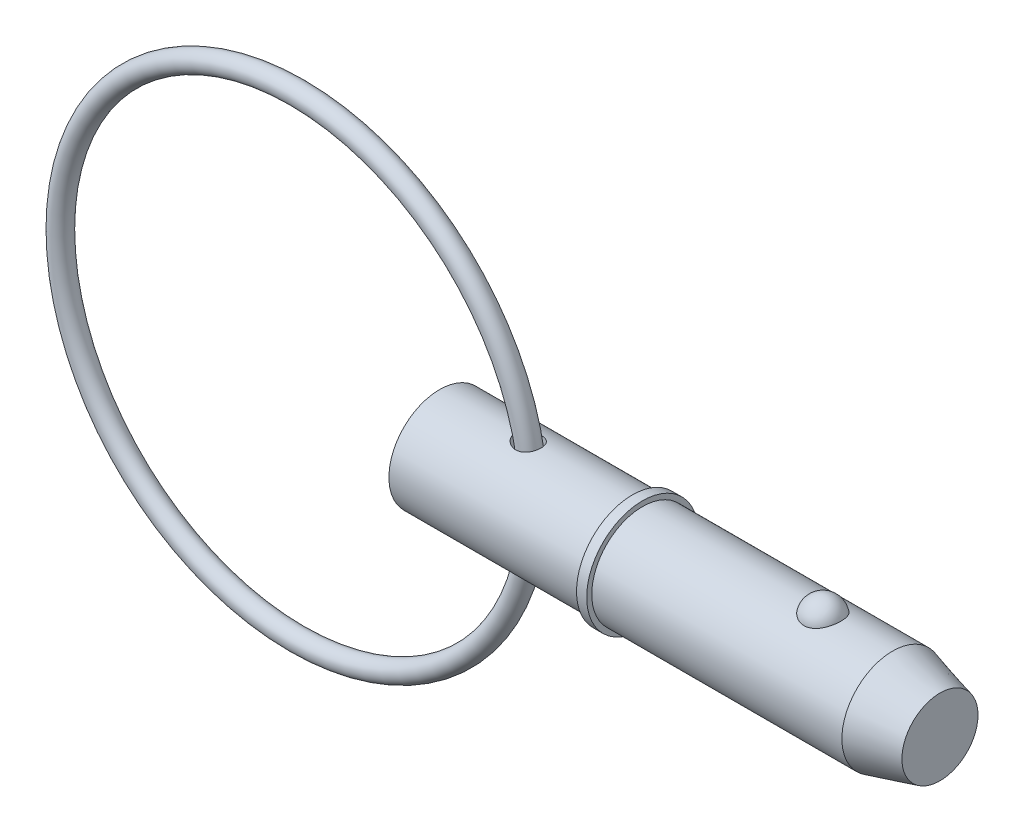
ISO-10303-21;
HEADER;
FILE_DESCRIPTION(('STEP AP214'),'2;1');
FILE_NAME('part.step','',(''),(''),'','','');
FILE_SCHEMA(('AUTOMOTIVE_DESIGN { 1 0 10303 214 1 1 1 1 }'));
ENDSEC;
DATA;
#1=APPLICATION_CONTEXT('core data for automotive mechanical design processes');
#2=APPLICATION_PROTOCOL_DEFINITION('international standard','automotive_design',2000,#1);
#3=PRODUCT_CONTEXT('',#1,'mechanical');
#4=PRODUCT('Part','Part','',(#3));
#5=PRODUCT_RELATED_PRODUCT_CATEGORY('part','',(#4));
#6=PRODUCT_DEFINITION_FORMATION('','',#4);
#7=PRODUCT_DEFINITION_CONTEXT('part definition',#1,'design');
#8=PRODUCT_DEFINITION('design','',#6,#7);
#9=PRODUCT_DEFINITION_SHAPE('','',#8);
#10=(LENGTH_UNIT() NAMED_UNIT(*) SI_UNIT(.MILLI.,.METRE.));
#11=(NAMED_UNIT(*) PLANE_ANGLE_UNIT() SI_UNIT($,.RADIAN.));
#12=(NAMED_UNIT(*) SI_UNIT($,.STERADIAN.) SOLID_ANGLE_UNIT());
#13=UNCERTAINTY_MEASURE_WITH_UNIT(LENGTH_MEASURE(1.E-05),#10,'distance_accuracy_value','');
#14=(GEOMETRIC_REPRESENTATION_CONTEXT(3) GLOBAL_UNCERTAINTY_ASSIGNED_CONTEXT((#13)) GLOBAL_UNIT_ASSIGNED_CONTEXT((#10,
#11,#12)) REPRESENTATION_CONTEXT('',''));
#15=CARTESIAN_POINT('',(0.,0.,0.));
#16=DIRECTION('',(0.,0.,1.));
#17=DIRECTION('',(1.,0.,0.));
#18=AXIS2_PLACEMENT_3D('',#15,#16,#17);
#19=CARTESIAN_POINT('',(-13.4013067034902,0.,0.));
#20=DIRECTION('',(0.,0.,1.));
#21=DIRECTION('',(1.,0.,0.));
#22=AXIS2_PLACEMENT_3D('',#19,#20,#21);
#23=TOROIDAL_SURFACE('',#22,22.225,0.952999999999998);
#24=CARTESIAN_POINT('',(9.77669329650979,0.,0.));
#25=VERTEX_POINT('',#24);
#26=VERTEX_LOOP('',#25);
#27=FACE_BOUND('',#26,.T.);
#28=ADVANCED_FACE('P0_F12',(#27),#23,.T.);
#29=CLOSED_SHELL('',(#28));
#30=MANIFOLD_SOLID_BREP('P0_B1',#29);
#31=CARTESIAN_POINT('',(0.,0.,0.));
#32=DIRECTION('',(1.,0.,0.));
#33=DIRECTION('',(0.,0.,-1.));
#34=AXIS2_PLACEMENT_3D('',#31,#32,#33);
#35=CYLINDRICAL_SURFACE('',#34,4.765);
#36=CARTESIAN_POINT('',(7.31773584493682,4.71580709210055,-0.682926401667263));
#37=CARTESIAN_POINT('',(7.3607471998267,4.70750812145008,-0.740230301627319));
#38=CARTESIAN_POINT('',(7.40883112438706,4.69869300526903,-0.79371122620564));
#39=CARTESIAN_POINT('',(7.51340999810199,4.68106981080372,-0.89180043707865));
#40=CARTESIAN_POINT('',(7.56991882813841,4.67226176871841,-0.936393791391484));
#41=CARTESIAN_POINT('',(7.689548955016,4.65568581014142,-1.01560363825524));
#42=CARTESIAN_POINT('',(7.75265928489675,4.64791621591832,-1.05023633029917));
#43=CARTESIAN_POINT('',(7.88387110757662,4.6343185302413,-1.10870278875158));
#44=CARTESIAN_POINT('',(7.95197058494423,4.62848966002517,-1.13254088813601));
#45=CARTESIAN_POINT('',(8.09209413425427,4.6194749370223,-1.16877415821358));
#46=CARTESIAN_POINT('',(8.16415141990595,4.6163169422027,-1.18104886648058));
#47=CARTESIAN_POINT('',(8.30937958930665,4.61324608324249,-1.19299123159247));
#48=CARTESIAN_POINT('',(8.38255011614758,4.61333220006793,-1.19266284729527));
#49=CARTESIAN_POINT('',(8.52374186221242,4.61674026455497,-1.17939593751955));
#50=CARTESIAN_POINT('',(8.59183022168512,4.61989017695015,-1.16712781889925));
#51=CARTESIAN_POINT('',(8.72470143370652,4.62884731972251,-1.13107903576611));
#52=CARTESIAN_POINT('',(8.78948513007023,4.63465386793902,-1.10730132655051));
#53=CARTESIAN_POINT('',(8.91088768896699,4.64792402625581,-1.05016249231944));
#54=CARTESIAN_POINT('',(8.96774302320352,4.65530108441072,-1.01728198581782));
#55=CARTESIAN_POINT('',(9.07499804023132,4.67102002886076,-0.942471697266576));
#56=CARTESIAN_POINT('',(9.12539777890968,4.6793619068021,-0.900541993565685));
#57=CARTESIAN_POINT('',(9.21836221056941,4.69607497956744,-0.808868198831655));
#58=CARTESIAN_POINT('',(9.26093651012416,4.70444612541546,-0.759133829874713));
#59=CARTESIAN_POINT('',(9.33728390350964,4.72032100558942,-0.653192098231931));
#60=CARTESIAN_POINT('',(9.3710564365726,4.72782468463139,-0.596984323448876));
#61=CARTESIAN_POINT('',(9.42940600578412,4.74126034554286,-0.478808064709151));
#62=CARTESIAN_POINT('',(9.45384681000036,4.74716869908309,-0.416769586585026));
#63=CARTESIAN_POINT('',(9.49226260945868,4.75663465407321,-0.289362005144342));
#64=CARTESIAN_POINT('',(9.50623742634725,4.76019221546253,-0.22399284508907));
#65=CARTESIAN_POINT('',(9.52342004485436,4.76458450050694,-0.0914886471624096));
#66=CARTESIAN_POINT('',(9.52658321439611,4.7654079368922,-0.0243474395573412));
#67=CARTESIAN_POINT('',(9.52194012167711,4.76421136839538,0.109528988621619));
#68=CARTESIAN_POINT('',(9.51413380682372,4.7621913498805,0.176264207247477));
#69=CARTESIAN_POINT('',(9.48775485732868,4.75552896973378,0.307367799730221));
#70=CARTESIAN_POINT('',(9.4691926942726,4.75088915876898,0.371738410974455));
#71=CARTESIAN_POINT('',(9.42175836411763,4.73949008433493,0.496364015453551));
#72=CARTESIAN_POINT('',(9.39288586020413,4.73273075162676,0.556618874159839));
#73=CARTESIAN_POINT('',(9.32549385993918,4.71782154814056,0.671371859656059));
#74=CARTESIAN_POINT('',(9.28696367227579,4.70967013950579,0.725863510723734));
#75=CARTESIAN_POINT('',(9.20123305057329,4.6928883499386,0.827453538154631));
#76=CARTESIAN_POINT('',(9.15403300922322,4.68425799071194,0.874552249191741));
#77=CARTESIAN_POINT('',(9.05250467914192,4.66754854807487,0.959736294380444));
#78=CARTESIAN_POINT('',(8.99822095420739,4.65946646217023,0.997874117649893));
#79=CARTESIAN_POINT('',(8.88381123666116,4.64472049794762,1.06440739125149));
#80=CARTESIAN_POINT('',(8.82368614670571,4.63805640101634,1.09280434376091));
#81=CARTESIAN_POINT('',(8.70022952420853,4.62698068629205,1.13878427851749));
#82=CARTESIAN_POINT('',(8.63695594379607,4.62253830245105,1.15651569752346));
#83=CARTESIAN_POINT('',(8.50825296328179,4.61622454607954,1.18146656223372));
#84=CARTESIAN_POINT('',(8.44282353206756,4.61435321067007,1.18868585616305));
#85=CARTESIAN_POINT('',(8.31119087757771,4.61332122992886,1.19268442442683));
#86=CARTESIAN_POINT('',(8.24498542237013,4.61417920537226,1.18939198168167));
#87=CARTESIAN_POINT('',(8.11397487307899,4.61847671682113,1.17259121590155));
#88=CARTESIAN_POINT('',(8.04917011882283,4.62191687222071,1.15908044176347));
#89=CARTESIAN_POINT('',(7.91946226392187,4.63117528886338,1.12153047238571));
#90=CARTESIAN_POINT('',(7.85470460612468,4.6371000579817,1.09701575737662));
#91=CARTESIAN_POINT('',(7.7300035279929,4.65063246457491,1.03814807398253));
#92=CARTESIAN_POINT('',(7.67006197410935,4.65824075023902,1.00379131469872));
#93=CARTESIAN_POINT('',(7.55352765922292,4.67473656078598,0.924015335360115));
#94=CARTESIAN_POINT('',(7.49726947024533,4.68366994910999,0.878115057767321));
#95=CARTESIAN_POINT('',(7.39344083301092,4.70144936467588,0.777311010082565));
#96=CARTESIAN_POINT('',(7.34587087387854,4.71029538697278,0.722406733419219));
#97=CARTESIAN_POINT('',(7.26188955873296,4.72669773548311,0.605773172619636));
#98=CARTESIAN_POINT('',(7.22531316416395,4.73427229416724,0.544165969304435));
#99=CARTESIAN_POINT('',(7.16406269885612,4.74732663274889,0.415095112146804));
#100=CARTESIAN_POINT('',(7.13937848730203,4.75280819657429,0.347636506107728));
#101=CARTESIAN_POINT('',(7.10494917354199,4.7605495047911,0.215359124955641));
#102=CARTESIAN_POINT('',(7.09405441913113,4.76305589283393,0.150853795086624));
#103=CARTESIAN_POINT('',(7.08387189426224,4.76539656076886,0.0208839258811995));
#104=CARTESIAN_POINT('',(7.0845805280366,4.76523166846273,-0.0445803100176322));
#105=CARTESIAN_POINT('',(7.09709111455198,4.76236014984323,-0.169693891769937));
#106=CARTESIAN_POINT('',(7.10810913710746,4.75983315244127,-0.229428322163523));
#107=CARTESIAN_POINT('',(7.13959099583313,4.75276726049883,-0.346187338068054));
#108=CARTESIAN_POINT('',(7.16004881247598,4.7482296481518,-0.403213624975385));
#109=CARTESIAN_POINT('',(7.20270325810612,4.73907067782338,-0.498040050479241));
#110=CARTESIAN_POINT('',(7.22286864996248,4.73481668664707,-0.536809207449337));
#111=CARTESIAN_POINT('',(7.26730952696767,4.72570777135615,-0.611832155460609));
#112=CARTESIAN_POINT('',(7.29158512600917,4.72085283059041,-0.64808587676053));
#113=CARTESIAN_POINT('',(7.31773584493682,4.71580709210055,-0.682926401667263));
#114=B_SPLINE_CURVE_WITH_KNOTS('',3,(#36,#37,#38,#39,#40,#41,#42,#43,#44,#45,#46,#47,#48,#49,
#50,#51,#52,#53,#54,#55,#56,#57,#58,#59,#60,#61,#62,#63,#64,#65,#66,#67,#68,#69,#70,#71,#72,#73,
#74,#75,#76,#77,#78,#79,#80,#81,#82,#83,#84,#85,#86,#87,#88,#89,#90,#91,#92,#93,#94,#95,#96,#97,
#98,#99,#100,#101,#102,#103,#104,#105,#106,#107,#108,#109,#110,#111,#112,#113),.UNSPECIFIED.,
.T.,.F.,(4,2,2,2,2,2,2,2,2,2,2,2,2,2,2,2,2,2,2,2,2,2,2,2,2,2,2,2,2,2,2,2,2,2,2,2,2,2,4),(0.,
0.216219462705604,0.432799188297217,0.649024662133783,0.865163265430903,1.08352938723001,
1.30182691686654,1.50853487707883,1.71518978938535,1.91252381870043,2.1098561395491,
2.30694457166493,2.50404555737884,2.70392296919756,2.90380378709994,3.10450875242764,
3.30521468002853,3.5057255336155,3.70624293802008,3.90698330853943,4.10771458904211,
4.30723900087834,4.50673262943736,4.70338139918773,4.90003300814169,5.09802914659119,
5.29607279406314,5.5036500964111,5.7113074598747,5.92972727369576,6.14815938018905,
6.36312650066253,6.57790998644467,6.77325899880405,6.96854747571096,7.15009726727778,
7.33153144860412,7.46298830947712,7.59444881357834),.UNSPECIFIED.);
#115=CARTESIAN_POINT('',(7.31773584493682,4.71580709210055,-0.682926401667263));
#116=VERTEX_POINT('',#115);
#117=EDGE_CURVE('P1_E42',#116,#116,#114,.T.);
#118=ORIENTED_EDGE('',*,*,#117,.T.);
#119=EDGE_LOOP('',(#118));
#120=FACE_BOUND('',#119,.T.);
#121=CARTESIAN_POINT('',(0.,0.,0.));
#122=DIRECTION('',(1.,0.,0.));
#123=DIRECTION('',(0.,0.,-1.));
#124=AXIS2_PLACEMENT_3D('',#121,#122,#123);
#125=CIRCLE('',#124,4.765);
#126=CARTESIAN_POINT('',(0.,0.,-4.765));
#127=VERTEX_POINT('',#126);
#128=EDGE_CURVE('P1_E9',#127,#127,#125,.T.);
#129=ORIENTED_EDGE('',*,*,#128,.T.);
#130=EDGE_LOOP('',(#129));
#131=FACE_BOUND('',#130,.T.);
#132=CARTESIAN_POINT('',(18.097,0.,0.));
#133=DIRECTION('',(1.,0.,0.));
#134=DIRECTION('',(0.,0.,-1.));
#135=AXIS2_PLACEMENT_3D('',#132,#133,#134);
#136=CIRCLE('',#135,4.765);
#137=CARTESIAN_POINT('',(18.097,0.,-4.765));
#138=VERTEX_POINT('',#137);
#139=EDGE_CURVE('P1_E25',#138,#138,#136,.T.);
#140=ORIENTED_EDGE('',*,*,#139,.F.);
#141=EDGE_LOOP('',(#140));
#142=FACE_BOUND('',#141,.T.);
#143=CARTESIAN_POINT('',(7.31773584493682,-4.71580709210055,-0.682926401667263));
#144=CARTESIAN_POINT('',(7.27956054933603,-4.72317282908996,-0.63206220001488));
#145=CARTESIAN_POINT('',(7.24535712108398,-4.7301361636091,-0.578155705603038));
#146=CARTESIAN_POINT('',(7.18611785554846,-4.74256090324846,-0.465352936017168));
#147=CARTESIAN_POINT('',(7.16107836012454,-4.74802290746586,-0.406458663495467));
#148=CARTESIAN_POINT('',(7.12119149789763,-4.75686558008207,-0.284913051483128));
#149=CARTESIAN_POINT('',(7.1063796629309,-4.76023898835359,-0.222249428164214));
#150=CARTESIAN_POINT('',(7.08786546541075,-4.76447177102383,-0.0952170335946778));
#151=CARTESIAN_POINT('',(7.08416018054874,-4.76533180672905,-0.0308487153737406));
#152=CARTESIAN_POINT('',(7.08795686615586,-4.76445764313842,0.0942755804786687));
#153=CARTESIAN_POINT('',(7.09490366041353,-4.762851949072,0.155050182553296));
#154=CARTESIAN_POINT('',(7.11863973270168,-4.75746086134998,0.2745356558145));
#155=CARTESIAN_POINT('',(7.13542953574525,-4.75367535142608,0.333246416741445));
#156=CARTESIAN_POINT('',(7.17817193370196,-4.74430545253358,0.447305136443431));
#157=CARTESIAN_POINT('',(7.20415836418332,-4.73871442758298,0.502639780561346));
#158=CARTESIAN_POINT('',(7.26428068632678,-4.72628508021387,0.608523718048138));
#159=CARTESIAN_POINT('',(7.29841897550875,-4.71944639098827,0.659071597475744));
#160=CARTESIAN_POINT('',(7.37680984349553,-4.70456239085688,0.758311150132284));
#161=CARTESIAN_POINT('',(7.42165519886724,-4.69646426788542,0.806526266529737));
#162=CARTESIAN_POINT('',(7.51828933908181,-4.68032890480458,0.895428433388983));
#163=CARTESIAN_POINT('',(7.57008134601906,-4.67229169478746,0.936111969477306));
#164=CARTESIAN_POINT('',(7.68397204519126,-4.65640659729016,1.01229731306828));
#165=CARTESIAN_POINT('',(7.74657226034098,-4.64863251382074,1.04706751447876));
#166=CARTESIAN_POINT('',(7.87680110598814,-4.6349740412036,1.10596507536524));
#167=CARTESIAN_POINT('',(7.94443054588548,-4.62908995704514,1.13009071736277));
#168=CARTESIAN_POINT('',(8.08402017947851,-4.61989019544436,1.16713943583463));
#169=CARTESIAN_POINT('',(8.15603143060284,-4.61661596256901,1.17988211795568));
#170=CARTESIAN_POINT('',(8.30124697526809,-4.61330446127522,1.1927680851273));
#171=CARTESIAN_POINT('',(8.37445077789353,-4.61326589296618,1.19291642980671));
#172=CARTESIAN_POINT('',(8.51584800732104,-4.61644036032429,1.18056687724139));
#173=CARTESIAN_POINT('',(8.58410302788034,-4.61948317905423,1.16873099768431));
#174=CARTESIAN_POINT('',(8.71738052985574,-4.6282520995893,1.13350536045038));
#175=CARTESIAN_POINT('',(8.78240382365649,-4.63397752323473,1.11011852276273));
#176=CARTESIAN_POINT('',(8.90428519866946,-4.64711877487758,1.05371003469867));
#177=CARTESIAN_POINT('',(8.96138096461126,-4.6544450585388,1.02117932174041));
#178=CARTESIAN_POINT('',(9.06916653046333,-4.6700970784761,0.947021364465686));
#179=CARTESIAN_POINT('',(9.11985639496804,-4.67842280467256,0.905394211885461));
#180=CARTESIAN_POINT('',(9.2134071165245,-4.69513303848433,0.814300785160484));
#181=CARTESIAN_POINT('',(9.25628268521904,-4.70351740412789,0.764849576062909));
#182=CARTESIAN_POINT('',(9.33327173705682,-4.71945185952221,0.659422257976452));
#183=CARTESIAN_POINT('',(9.3673846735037,-4.72700189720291,0.603445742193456));
#184=CARTESIAN_POINT('',(9.42645214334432,-4.74055953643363,0.485673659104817));
#185=CARTESIAN_POINT('',(9.45127042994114,-4.74654383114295,0.423807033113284));
#186=CARTESIAN_POINT('',(9.49046298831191,-4.756182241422,0.296676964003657));
#187=CARTESIAN_POINT('',(9.50483706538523,-4.75983631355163,0.231413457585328));
#188=CARTESIAN_POINT('',(9.52283408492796,-4.76443282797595,0.0990368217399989));
#189=CARTESIAN_POINT('',(9.52641016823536,-4.76536345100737,0.0319169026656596));
#190=CARTESIAN_POINT('',(9.52259067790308,-4.76437893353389,-0.101988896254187));
#191=CARTESIAN_POINT('',(9.5151950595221,-4.76246378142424,-0.168774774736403));
#192=CARTESIAN_POINT('',(9.48962516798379,-4.75599746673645,-0.300048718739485));
#193=CARTESIAN_POINT('',(9.4714615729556,-4.75144891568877,-0.364538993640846));
#194=CARTESIAN_POINT('',(9.42480303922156,-4.74020887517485,-0.489470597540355));
#195=CARTESIAN_POINT('',(9.396307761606,-4.73351731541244,-0.549911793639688));
#196=CARTESIAN_POINT('',(9.32963953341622,-4.71871240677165,-0.665099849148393));
#197=CARTESIAN_POINT('',(9.29145577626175,-4.71059747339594,-0.719840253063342));
#198=CARTESIAN_POINT('',(9.20637695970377,-4.69385254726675,-0.82198328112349));
#199=CARTESIAN_POINT('',(9.15948227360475,-4.68522257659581,-0.869386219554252));
#200=CARTESIAN_POINT('',(9.05849937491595,-4.66847516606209,-0.955233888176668));
#201=CARTESIAN_POINT('',(9.00445430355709,-4.6603550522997,-0.993728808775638));
#202=CARTESIAN_POINT('',(8.8904576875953,-4.64550122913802,-1.06100691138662));
#203=CARTESIAN_POINT('',(8.83050704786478,-4.63876730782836,-1.08979157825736));
#204=CARTESIAN_POINT('',(8.70732873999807,-4.6275305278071,-1.13655620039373));
#205=CARTESIAN_POINT('',(8.64416019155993,-4.62299714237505,-1.15468477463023));
#206=CARTESIAN_POINT('',(8.51559711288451,-4.61649071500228,-1.18043067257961));
#207=CARTESIAN_POINT('',(8.4502025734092,-4.61451768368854,-1.18804795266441));
#208=CARTESIAN_POINT('',(8.31862013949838,-4.61328355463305,-1.19283094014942));
#209=CARTESIAN_POINT('',(8.25242983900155,-4.61403911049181,-1.18993246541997));
#210=CARTESIAN_POINT('',(8.12138461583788,-4.61814057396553,-1.17391149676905));
#211=CARTESIAN_POINT('',(8.0565300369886,-4.62148714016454,-1.16078640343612));
#212=CARTESIAN_POINT('',(7.92669960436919,-4.63056912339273,-1.12402333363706));
#213=CARTESIAN_POINT('',(7.86186447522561,-4.63641051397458,-1.09991536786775));
#214=CARTESIAN_POINT('',(7.73694230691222,-4.64980121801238,-1.04185298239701));
#215=CARTESIAN_POINT('',(7.6768568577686,-4.65735110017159,-1.0078952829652));
#216=CARTESIAN_POINT('',(7.56207884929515,-4.67346080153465,-0.930364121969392));
#217=CARTESIAN_POINT('',(7.5074784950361,-4.68203382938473,-0.886656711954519));
#218=CARTESIAN_POINT('',(7.40624045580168,-4.69916824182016,-0.79082583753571));
#219=CARTESIAN_POINT('',(7.35959988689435,-4.7077296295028,-0.738705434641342));
#220=CARTESIAN_POINT('',(7.31773584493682,-4.71580709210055,-0.682926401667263));
#221=B_SPLINE_CURVE_WITH_KNOTS('',3,(#143,#144,#145,#146,#147,#148,#149,#150,#151,#152,#153,
#154,#155,#156,#157,#158,#159,#160,#161,#162,#163,#164,#165,#166,#167,#168,#169,#170,#171,#172,
#173,#174,#175,#176,#177,#178,#179,#180,#181,#182,#183,#184,#185,#186,#187,#188,#189,#190,#191,
#192,#193,#194,#195,#196,#197,#198,#199,#200,#201,#202,#203,#204,#205,#206,#207,#208,#209,#210,
#211,#212,#213,#214,#215,#216,#217,#218,#219,#220),.UNSPECIFIED.,.T.,.F.,(4,2,2,2,2,2,2,2,2,2,2,
2,2,2,2,2,2,2,2,2,2,2,2,2,2,2,2,2,2,2,2,2,2,2,2,2,2,2,4),(0.,0.191851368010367,0.38362606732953,
0.576063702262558,0.768450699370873,0.951145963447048,1.13385097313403,1.31723528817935,
1.50067360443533,1.69887079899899,1.8971602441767,2.11225870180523,2.32739185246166,
2.54587681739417,2.76427400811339,2.97123130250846,3.17813630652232,3.37555441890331,
3.57297054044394,3.77001106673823,3.96706388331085,4.16690159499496,4.36674303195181,
4.56745046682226,4.76815872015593,4.96866827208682,5.16918440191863,5.36992517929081,
5.5706573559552,5.77022940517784,5.96977092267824,6.16645904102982,6.36314797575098,
6.56103940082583,6.75898114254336,6.96633026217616,7.17374850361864,7.384214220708,
7.59460352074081),.UNSPECIFIED.);
#222=CARTESIAN_POINT('',(7.31773584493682,-4.71580709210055,-0.682926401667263));
#223=VERTEX_POINT('',#222);
#224=EDGE_CURVE('P1_E17',#223,#223,#221,.T.);
#225=ORIENTED_EDGE('',*,*,#224,.T.);
#226=EDGE_LOOP('',(#225));
#227=FACE_BOUND('',#226,.T.);
#228=ADVANCED_FACE('P1_F13',(#120,#131,#142,#227),#35,.T.);
#229=CARTESIAN_POINT('',(0.,0.,0.));
#230=DIRECTION('',(1.,0.,0.));
#231=DIRECTION('',(0.,0.,-1.));
#232=AXIS2_PLACEMENT_3D('',#229,#230,#231);
#233=CYLINDRICAL_SURFACE('',#232,4.765);
#234=CARTESIAN_POINT('',(42.5441944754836,0.,0.));
#235=DIRECTION('',(1.,0.,0.));
#236=DIRECTION('',(0.,0.,-1.));
#237=AXIS2_PLACEMENT_3D('',#234,#235,#236);
#238=CIRCLE('',#237,4.765);
#239=CARTESIAN_POINT('',(42.5441944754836,0.,-4.765));
#240=VERTEX_POINT('',#239);
#241=EDGE_CURVE('P1_E99',#240,#240,#238,.T.);
#242=ORIENTED_EDGE('',*,*,#241,.F.);
#243=EDGE_LOOP('',(#242));
#244=FACE_BOUND('',#243,.T.);
#245=CARTESIAN_POINT('',(19.05,0.,0.));
#246=DIRECTION('',(1.,0.,0.));
#247=DIRECTION('',(0.,0.,-1.));
#248=AXIS2_PLACEMENT_3D('',#245,#246,#247);
#249=CIRCLE('',#248,4.765);
#250=CARTESIAN_POINT('',(19.05,0.,-4.765));
#251=VERTEX_POINT('',#250);
#252=EDGE_CURVE('P1_E96',#251,#251,#249,.T.);
#253=ORIENTED_EDGE('',*,*,#252,.T.);
#254=EDGE_LOOP('',(#253));
#255=FACE_BOUND('',#254,.T.);
#256=CARTESIAN_POINT('',(35.991020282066,4.42764777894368,1.76101111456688));
#257=CARTESIAN_POINT('',(35.8997212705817,4.42764470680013,1.76101422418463));
#258=CARTESIAN_POINT('',(35.8084468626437,4.43059091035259,1.75366340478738));
#259=CARTESIAN_POINT('',(35.6286154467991,4.44201846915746,1.72451180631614));
#260=CARTESIAN_POINT('',(35.5400577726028,4.45049845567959,1.70271460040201));
#261=CARTESIAN_POINT('',(35.3682570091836,4.47200516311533,1.64539370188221));
#262=CARTESIAN_POINT('',(35.2850064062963,4.48502527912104,1.60988994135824));
#263=CARTESIAN_POINT('',(35.1257633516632,4.51419542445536,1.52617873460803));
#264=CARTESIAN_POINT('',(35.0497723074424,4.53034605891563,1.47796883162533));
#265=CARTESIAN_POINT('',(34.9047445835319,4.5645931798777,1.36860494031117));
#266=CARTESIAN_POINT('',(34.8359645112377,4.58273170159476,1.30712420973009));
#267=CARTESIAN_POINT('',(34.7093423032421,4.61870302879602,1.17370204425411));
#268=CARTESIAN_POINT('',(34.6515021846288,4.63653577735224,1.10175868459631));
#269=CARTESIAN_POINT('',(34.5455709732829,4.67090140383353,0.945806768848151));
#270=CARTESIAN_POINT('',(34.4980305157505,4.68734068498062,0.861402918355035));
#271=CARTESIAN_POINT('',(34.4170817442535,4.71628466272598,0.685442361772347));
#272=CARTESIAN_POINT('',(34.3836747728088,4.72878898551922,0.593884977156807));
#273=CARTESIAN_POINT('',(34.3312871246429,4.74874061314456,0.404781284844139));
#274=CARTESIAN_POINT('',(34.3125178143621,4.75611366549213,0.307168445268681));
#275=CARTESIAN_POINT('',(34.2905846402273,4.76475393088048,0.109940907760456));
#276=CARTESIAN_POINT('',(34.2874205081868,4.76602124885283,0.0103262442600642));
#277=CARTESIAN_POINT('',(34.2967405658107,4.76232928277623,-0.187629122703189));
#278=CARTESIAN_POINT('',(34.3091588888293,4.7573962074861,-0.285973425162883));
#279=CARTESIAN_POINT('',(34.3492804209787,4.74184975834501,-0.479027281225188));
#280=CARTESIAN_POINT('',(34.3769839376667,4.7312362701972,-0.573736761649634));
#281=CARTESIAN_POINT('',(34.4471581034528,4.70540026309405,-0.756973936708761));
#282=CARTESIAN_POINT('',(34.4896460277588,4.69017235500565,-0.845494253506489));
#283=CARTESIAN_POINT('',(34.588520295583,4.6566986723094,-1.01378033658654));
#284=CARTESIAN_POINT('',(34.6449076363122,4.63845268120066,-1.09354547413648));
#285=CARTESIAN_POINT('',(34.770552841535,4.60085438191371,-1.24228523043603));
#286=CARTESIAN_POINT('',(34.8398439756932,4.58149930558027,-1.31123108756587));
#287=CARTESIAN_POINT('',(34.9896066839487,4.54391653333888,-1.43607409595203));
#288=CARTESIAN_POINT('',(35.0700771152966,4.52568872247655,-1.49197257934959));
#289=CARTESIAN_POINT('',(35.2381500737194,4.49293007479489,-1.58786764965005));
#290=CARTESIAN_POINT('',(35.3255445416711,4.47832346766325,-1.62820219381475));
#291=CARTESIAN_POINT('',(35.5065534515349,4.45406011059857,-1.69345757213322));
#292=CARTESIAN_POINT('',(35.6001655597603,4.44440151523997,-1.71838415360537));
#293=CARTESIAN_POINT('',(35.7858939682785,4.43159888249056,-1.75112843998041));
#294=CARTESIAN_POINT('',(35.877849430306,4.42815213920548,-1.75974223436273));
#295=CARTESIAN_POINT('',(36.0619658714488,4.427247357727,-1.76201865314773));
#296=CARTESIAN_POINT('',(36.1541268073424,4.42978816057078,-1.7556841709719));
#297=CARTESIAN_POINT('',(36.3331292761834,4.4403864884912,-1.72869560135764));
#298=CARTESIAN_POINT('',(36.4200474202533,4.44827555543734,-1.70847853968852));
#299=CARTESIAN_POINT('',(36.5891314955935,4.46852246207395,-1.65479562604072));
#300=CARTESIAN_POINT('',(36.671297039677,4.48088066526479,-1.62132869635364));
#301=CARTESIAN_POINT('',(36.8305916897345,4.50907357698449,-1.54120560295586));
#302=CARTESIAN_POINT('',(36.9075700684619,4.52497884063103,-1.49427526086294));
#303=CARTESIAN_POINT('',(37.0527080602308,4.55845148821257,-1.38881222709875));
#304=CARTESIAN_POINT('',(37.1208656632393,4.57601924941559,-1.33027689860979));
#305=CARTESIAN_POINT('',(37.2500990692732,4.61196537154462,-1.19991049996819));
#306=CARTESIAN_POINT('',(37.3106562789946,4.63034074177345,-1.12756415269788));
#307=CARTESIAN_POINT('',(37.4192797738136,4.66513959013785,-0.973612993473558));
#308=CARTESIAN_POINT('',(37.4673438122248,4.68156271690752,-0.892006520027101));
#309=CARTESIAN_POINT('',(37.551383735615,4.71130224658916,-0.718892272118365));
#310=CARTESIAN_POINT('',(37.5869185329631,4.724501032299,-0.627149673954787));
#311=CARTESIAN_POINT('',(37.6429522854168,4.74571823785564,-0.438611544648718));
#312=CARTESIAN_POINT('',(37.663450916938,4.75373654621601,-0.341815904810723));
#313=CARTESIAN_POINT('',(37.6890338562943,4.76378905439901,-0.145633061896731));
#314=CARTESIAN_POINT('',(37.694076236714,4.76580697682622,-0.046239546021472));
#315=CARTESIAN_POINT('',(37.6885239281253,4.76360573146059,0.15203857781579));
#316=CARTESIAN_POINT('',(37.6779294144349,4.75938663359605,0.250923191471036));
#317=CARTESIAN_POINT('',(37.6413875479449,4.74516937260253,0.445004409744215));
#318=CARTESIAN_POINT('',(37.6154964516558,4.73519238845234,0.540213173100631));
#319=CARTESIAN_POINT('',(37.5489273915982,4.7104939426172,0.724662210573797));
#320=CARTESIAN_POINT('',(37.5082485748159,4.69577220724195,0.81390214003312));
#321=CARTESIAN_POINT('',(37.4127177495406,4.66303767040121,0.984313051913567));
#322=CARTESIAN_POINT('',(37.3578042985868,4.64501070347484,1.06544688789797));
#323=CARTESIAN_POINT('',(37.2350496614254,4.60764678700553,1.21692673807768));
#324=CARTESIAN_POINT('',(37.1672086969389,4.58830985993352,1.2872729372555));
#325=CARTESIAN_POINT('',(37.0205480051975,4.55060370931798,1.41479271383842));
#326=CARTESIAN_POINT('',(36.9417918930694,4.53222967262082,1.47203785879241));
#327=CARTESIAN_POINT('',(36.7749890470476,4.49849576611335,1.57212016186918));
#328=CARTESIAN_POINT('',(36.6869417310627,4.48313608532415,1.61495641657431));
#329=CARTESIAN_POINT('',(36.4997918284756,4.45676184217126,1.68642657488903));
#330=CARTESIAN_POINT('',(36.4003653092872,4.44598302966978,1.71430590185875));
#331=CARTESIAN_POINT('',(36.1976210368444,4.43142918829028,1.7515925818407));
#332=CARTESIAN_POINT('',(36.0943049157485,4.42765125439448,1.76100759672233));
#333=CARTESIAN_POINT('',(35.991020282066,4.42764777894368,1.76101111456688));
#334=B_SPLINE_CURVE_WITH_KNOTS('',3,(#256,#257,#258,#259,#260,#261,#262,#263,#264,#265,#266,
#267,#268,#269,#270,#271,#272,#273,#274,#275,#276,#277,#278,#279,#280,#281,#282,#283,#284,#285,
#286,#287,#288,#289,#290,#291,#292,#293,#294,#295,#296,#297,#298,#299,#300,#301,#302,#303,#304,
#305,#306,#307,#308,#309,#310,#311,#312,#313,#314,#315,#316,#317,#318,#319,#320,#321,#322,#323,
#324,#325,#326,#327,#328,#329,#330,#331,#332,#333),.UNSPECIFIED.,.T.,.F.,(4,2,2,2,2,2,2,2,2,2,2,
2,2,2,2,2,2,2,2,2,2,2,2,2,2,2,2,2,2,2,2,2,2,2,2,2,2,2,4),(0.,0.273517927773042,
0.546968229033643,0.820022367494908,1.09312934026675,1.37393946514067,1.65480131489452,
1.94820420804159,2.24163496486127,2.53922817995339,2.83681628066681,3.13315071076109,
3.42949110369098,3.72617893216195,4.02288805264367,4.32037303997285,4.61782764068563,
4.90840095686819,5.19886582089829,5.4747485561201,5.75057789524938,6.01809977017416,
6.28564340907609,6.55907787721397,6.83257454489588,7.11962987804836,7.40673679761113,
7.70312663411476,7.99952284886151,8.29672237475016,8.59391856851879,8.89002850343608,
9.18615552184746,9.483582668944,9.78100471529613,10.0767610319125,10.3725358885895,
10.6820893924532,10.991514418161),.UNSPECIFIED.);
#335=CARTESIAN_POINT('',(35.991020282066,4.42764777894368,1.76101111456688));
#336=VERTEX_POINT('',#335);
#337=EDGE_CURVE('P1_E34',#336,#336,#334,.T.);
#338=ORIENTED_EDGE('',*,*,#337,.T.);
#339=EDGE_LOOP('',(#338));
#340=FACE_BOUND('',#339,.T.);
#341=ADVANCED_FACE('P1_F46',(#244,#255,#340),#233,.T.);
#342=CARTESIAN_POINT('',(0.,0.,0.));
#343=DIRECTION('',(-1.,0.,0.));
#344=DIRECTION('',(0.,0.,1.));
#345=AXIS2_PLACEMENT_3D('',#342,#343,#344);
#346=PLANE('',#345);
#347=ORIENTED_EDGE('',*,*,#128,.F.);
#348=EDGE_LOOP('',(#347));
#349=FACE_BOUND('',#348,.T.);
#350=ADVANCED_FACE('P1_F15',(#349),#346,.T.);
#351=CARTESIAN_POINT('',(18.097,4.765,0.));
#352=DIRECTION('',(-1.,0.,0.));
#353=DIRECTION('',(0.,0.,1.));
#354=AXIS2_PLACEMENT_3D('',#351,#352,#353);
#355=PLANE('',#354);
#356=ORIENTED_EDGE('',*,*,#139,.T.);
#357=EDGE_LOOP('',(#356));
#358=FACE_BOUND('',#357,.T.);
#359=CARTESIAN_POINT('',(18.097,0.,0.));
#360=DIRECTION('',(1.,0.,0.));
#361=DIRECTION('',(0.,0.,-1.));
#362=AXIS2_PLACEMENT_3D('',#359,#360,#361);
#363=CIRCLE('',#362,5.2415);
#364=CARTESIAN_POINT('',(18.097,0.,-5.2415));
#365=VERTEX_POINT('',#364);
#366=EDGE_CURVE('P1_E30',#365,#365,#363,.T.);
#367=ORIENTED_EDGE('',*,*,#366,.F.);
#368=EDGE_LOOP('',(#367));
#369=FACE_BOUND('',#368,.T.);
#370=ADVANCED_FACE('P1_F81',(#358,#369),#355,.T.);
#371=CARTESIAN_POINT('',(0.,0.,0.));
#372=DIRECTION('',(1.,0.,0.));
#373=DIRECTION('',(0.,0.,-1.));
#374=AXIS2_PLACEMENT_3D('',#371,#372,#373);
#375=CYLINDRICAL_SURFACE('',#374,5.2415);
#376=ORIENTED_EDGE('',*,*,#366,.T.);
#377=EDGE_LOOP('',(#376));
#378=FACE_BOUND('',#377,.T.);
#379=CARTESIAN_POINT('',(19.05,0.,0.));
#380=DIRECTION('',(1.,0.,0.));
#381=DIRECTION('',(0.,0.,-1.));
#382=AXIS2_PLACEMENT_3D('',#379,#380,#381);
#383=CIRCLE('',#382,5.2415);
#384=CARTESIAN_POINT('',(19.05,0.,-5.2415));
#385=VERTEX_POINT('',#384);
#386=EDGE_CURVE('P1_E95',#385,#385,#383,.T.);
#387=ORIENTED_EDGE('',*,*,#386,.F.);
#388=EDGE_LOOP('',(#387));
#389=FACE_BOUND('',#388,.T.);
#390=ADVANCED_FACE('P1_F68',(#378,#389),#375,.T.);
#391=CARTESIAN_POINT('',(19.05,5.2415,0.));
#392=DIRECTION('',(1.,0.,0.));
#393=DIRECTION('',(0.,0.,-1.));
#394=AXIS2_PLACEMENT_3D('',#391,#392,#393);
#395=PLANE('',#394);
#396=ORIENTED_EDGE('',*,*,#386,.T.);
#397=EDGE_LOOP('',(#396));
#398=FACE_BOUND('',#397,.T.);
#399=ORIENTED_EDGE('',*,*,#252,.F.);
#400=EDGE_LOOP('',(#399));
#401=FACE_BOUND('',#400,.T.);
#402=ADVANCED_FACE('P1_F62',(#398,#401),#395,.T.);
#403=CARTESIAN_POINT('',(46.99,0.,0.));
#404=DIRECTION('',(-1.,0.,0.));
#405=DIRECTION('',(0.,0.,1.));
#406=AXIS2_PLACEMENT_3D('',#403,#404,#405);
#407=CONICAL_SURFACE('',#406,3.57375000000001,0.261799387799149);
#408=ORIENTED_EDGE('',*,*,#241,.T.);
#409=EDGE_LOOP('',(#408));
#410=FACE_BOUND('',#409,.T.);
#411=CARTESIAN_POINT('',(46.99,0.,0.));
#412=DIRECTION('',(1.,0.,0.));
#413=DIRECTION('',(0.,0.,-1.));
#414=AXIS2_PLACEMENT_3D('',#411,#412,#413);
#415=CIRCLE('',#414,3.57375000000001);
#416=CARTESIAN_POINT('',(46.99,0.,-3.57375000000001));
#417=VERTEX_POINT('',#416);
#418=EDGE_CURVE('P1_E41',#417,#417,#415,.T.);
#419=ORIENTED_EDGE('',*,*,#418,.F.);
#420=EDGE_LOOP('',(#419));
#421=FACE_BOUND('',#420,.T.);
#422=ADVANCED_FACE('P1_F59',(#410,#421),#407,.T.);
#423=CARTESIAN_POINT('',(46.99,3.57375000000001,0.));
#424=DIRECTION('',(1.,0.,0.));
#425=DIRECTION('',(0.,0.,-1.));
#426=AXIS2_PLACEMENT_3D('',#423,#424,#425);
#427=PLANE('',#426);
#428=ORIENTED_EDGE('',*,*,#418,.T.);
#429=EDGE_LOOP('',(#428));
#430=FACE_BOUND('',#429,.T.);
#431=ADVANCED_FACE('P1_F55',(#430),#427,.T.);
#432=CARTESIAN_POINT('',(35.991020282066,4.2885,0.));
#433=DIRECTION('',(-1.,0.,0.));
#434=DIRECTION('',(0.,1.,0.));
#435=AXIS2_PLACEMENT_3D('',#432,#433,#434);
#436=SPHERICAL_SURFACE('',#435,1.7665);
#437=ORIENTED_EDGE('',*,*,#337,.F.);
#438=EDGE_LOOP('',(#437));
#439=FACE_BOUND('',#438,.T.);
#440=ADVANCED_FACE('P1_F50',(#439),#436,.T.);
#441=CARTESIAN_POINT('',(-13.4013067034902,0.,0.));
#442=DIRECTION('',(0.,0.,1.));
#443=DIRECTION('',(1.,0.,0.));
#444=AXIS2_PLACEMENT_3D('',#441,#442,#443);
#445=TOROIDAL_SURFACE('',#444,22.225,1.19125);
#446=ORIENTED_EDGE('',*,*,#224,.F.);
#447=EDGE_LOOP('',(#446));
#448=FACE_BOUND('',#447,.T.);
#449=ORIENTED_EDGE('',*,*,#117,.F.);
#450=EDGE_LOOP('',(#449));
#451=FACE_BOUND('',#450,.T.);
#452=ADVANCED_FACE('P1_F54',(#448,#451),#445,.F.);
#453=CLOSED_SHELL('',(#228,#341,#350,#370,#390,#402,#422,#431,#440,#452));
#454=MANIFOLD_SOLID_BREP('P1_B1',#453);
#455=ADVANCED_BREP_SHAPE_REPRESENTATION('',(#18,#30,#454),#14);
#456=SHAPE_DEFINITION_REPRESENTATION(#9,#455);
ENDSEC;
END-ISO-10303-21;
